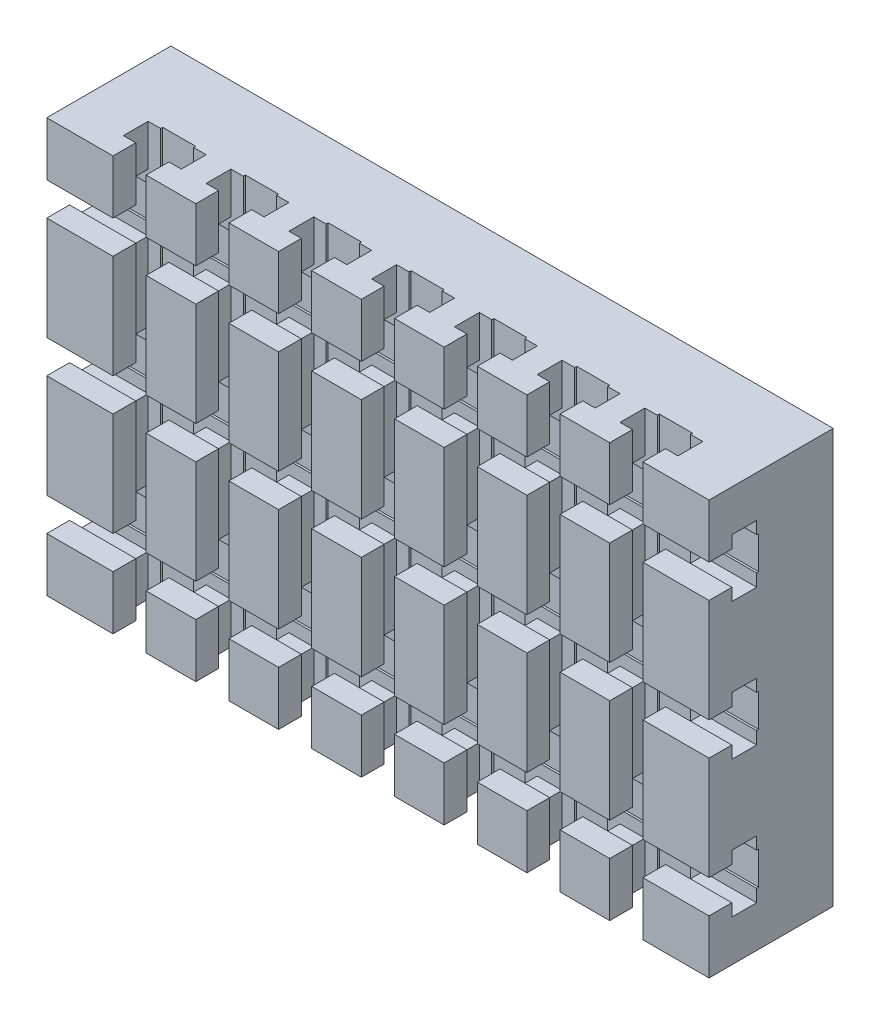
from build123d import *

# Parameters (mm, degrees)
SKETCH1_W           = 160
SKETCH1_H           = 100
BOSS_EXTRUDE1_DEPTH = 30
SKETCH2_W           = 5.5
SKETCH2_H           = 8
SKETCH2_W_2         = 6
SKETCH2_H_2         = 3
SKETCH2_W_3         = 0.5
CUT_EXTRUDE1_DEPTH  = 171.293863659
SKETCH3_W           = 8
SKETCH3_H           = 5.5
SKETCH3_H_2         = 6
SKETCH3_H_3         = 0.5
SKETCH3_W_2         = 3
CUT_EXTRUDE2_DEPTH  = 132.52946438
LPATTERN1_COUNT     = 4
LPATTERN1_PITCH     = 20
LPATTERN1_COL_COUNT = 4
LPATTERN1_COL_PITCH = 20


with BuildPart() as part:
    # Sketch1 → Boss-Extrude1 (new body)
    with BuildSketch(Plane.XY):
        Rectangle(SKETCH1_W, SKETCH1_H)
    extrude(amount=BOSS_EXTRUDE1_DEPTH)

    # Sketch2 → Cut-Extrude1 (cut, through all)
    with BuildSketch(Plane(origin=(80, 0, 0), x_dir=(0, 0, -1), z_dir=(1, 0, 0))):
        with Locations((-27.25, -33)):
            Rectangle(SKETCH2_W, SKETCH2_H)
        with Locations((-21.5, -33)):
            Rectangle(SKETCH2_W_2, SKETCH2_H)
        with Locations((-21.5, -38.5)):
            Rectangle(SKETCH2_W_2, SKETCH2_H_2)
        with Locations((-21.5, -27.5)):
            Rectangle(SKETCH2_W_2, SKETCH2_H_2)
        with Locations((-18.25, -33)):
            Rectangle(SKETCH2_W_3, SKETCH2_H)
        with Locations((-21.5, 0)):
            Rectangle(SKETCH2_W_2, SKETCH2_H)
        with Locations((-21.5, -5.5)):
            Rectangle(SKETCH2_W_2, SKETCH2_H_2)
        with Locations((-27.25, 0)):
            Rectangle(SKETCH2_W, SKETCH2_H)
        with Locations((-21.5, 5.5)):
            Rectangle(SKETCH2_W_2, SKETCH2_H_2)
        with Locations((-18.25, 0)):
            Rectangle(SKETCH2_W_3, SKETCH2_H)
        with Locations((-21.5, 27.5)):
            Rectangle(SKETCH2_W_2, SKETCH2_H_2)
        with Locations((-21.5, 33)):
            Rectangle(SKETCH2_W_2, SKETCH2_H)
        with Locations((-18.25, 33)):
            Rectangle(SKETCH2_W_3, SKETCH2_H)
        with Locations((-27.25, 33)):
            Rectangle(SKETCH2_W, SKETCH2_H)
        with Locations((-21.5, 38.5)):
            Rectangle(SKETCH2_W_2, SKETCH2_H_2)
    extrude(amount=-CUT_EXTRUDE1_DEPTH, mode=Mode.SUBTRACT)

    # Sketch3 → Cut-Extrude2 (cut, through all)
    with BuildSketch(Plane.XZ.offset(50)):
        with Locations((0, 27.25)):
            Rectangle(SKETCH3_W, SKETCH3_H)
        with Locations((0, 21.5)):
            Rectangle(SKETCH3_W, SKETCH3_H_2)
        with Locations((0, 18.25)):
            Rectangle(SKETCH3_W, SKETCH3_H_3)
        with Locations((5.5, 21.5)):
            Rectangle(SKETCH3_W_2, SKETCH3_H_2)
        with Locations((-5.5, 21.5)):
            Rectangle(SKETCH3_W_2, SKETCH3_H_2)
    cut_extrude2 = extrude(amount=-CUT_EXTRUDE2_DEPTH, mode=Mode.SUBTRACT)

    # LPattern1: Cut-Extrude2 ×4
    with Locations(*[(-i * LPATTERN1_PITCH, 0, 0) for i in range(1, LPATTERN1_COUNT)]):
        add(cut_extrude2, mode=Mode.SUBTRACT)

    # LPattern1 col: Cut-Extrude2 ×4
    with Locations(*[(i * LPATTERN1_COL_PITCH, 0, 0) for i in range(1, LPATTERN1_COL_COUNT)]):
        add(cut_extrude2, mode=Mode.SUBTRACT)


solid = part.part
